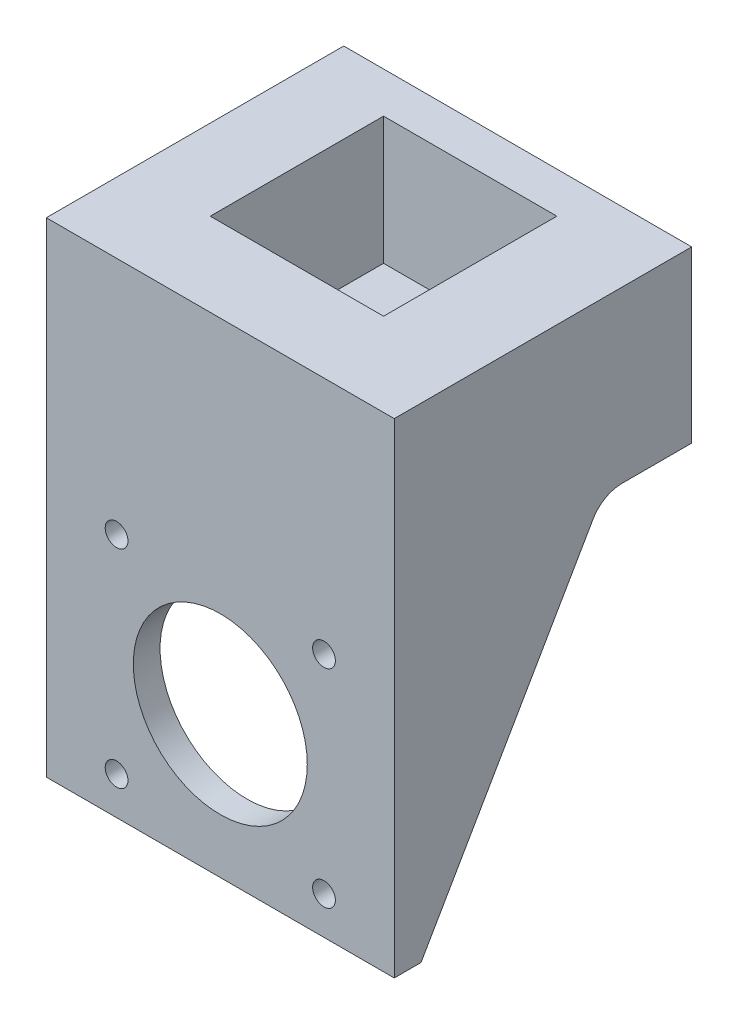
from build123d import *

# Parameters (mm, degrees)
SKETCH1_W           = 83.82
SKETCH1_H           = 25.4
BOSS_EXTRUDE1_DEPTH = 6.35
SKETCH4_W           = 52
SKETCH4_H           = 25.4
BOSS_EXTRUDE2_DEPTH = 44.45
SKETCH5_W           = 25.9
SKETCH5_H           = 25.9
CUT_EXTRUDE1_DEPTH  = 19.05
SKETCH7_R           = 3.429
CUT_EXTRUDE2_DEPTH  = 69.556477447
SKETCH10_W          = 8
SKETCH10_H          = 4
CUT_EXTRUDE3_DEPTH  = 99.831788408
CUT_EXTRUDE4_DEPTH  = 63.398241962
SKETCH11_W          = 83.82
SKETCH11_H          = 25.4
BOSS_EXTRUDE3_DEPTH = 2.54
SKETCH13_W          = 8.89
SKETCH13_H          = 25.4
CUT_EXTRUDE7_DEPTH  = 99.831788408
SKETCH14_W          = 52
SKETCH14_H          = 4
BOSS_EXTRUDE4_DEPTH = 47
BOSS_EXTRUDE7_DEPTH = 3
SKETCH15_R          = 1.7
CUT_EXTRUDE8_DEPTH  = 79.840931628
BOSS_EXTRUDE5_DEPTH = 3
SKETCH19_R          = 13
CUT_EXTRUDE9_DEPTH  = 79.840931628
FILLET3_R           = 5
FILLET4_R           = 5


with BuildPart() as part:
    # Sketch1 → Boss-Extrude1 (new body)
    with BuildSketch(Plane.XY):
        Rectangle(SKETCH1_W, SKETCH1_H)
    extrude(amount=BOSS_EXTRUDE1_DEPTH)

    # Sketch4 → Boss-Extrude2 (add)
    with BuildSketch(Plane.XY.offset(6.35)):
        Rectangle(SKETCH4_W, SKETCH4_H)
    extrude(amount=BOSS_EXTRUDE2_DEPTH)

    # Sketch5 → Cut-Extrude1 (cut)
    with BuildSketch(Plane(origin=(0, 12.7, 0), x_dir=(1, 0, 0), z_dir=(0, 1, 0))):
        with Locations((-1, -25.4)):
            Rectangle(SKETCH5_W, SKETCH5_H)
    extrude(amount=-CUT_EXTRUDE1_DEPTH, mode=Mode.SUBTRACT)

    # Sketch7 → Cut-Extrude2 (cut, through all)
    with BuildSketch(Plane(origin=(0, -6.35, 0), x_dir=(1, 0, 0), z_dir=(0, 1, 0))):
        with Locations(Location((-1, -25.4, 0), (0, 0, 270))):
            Circle(SKETCH7_R)
    extrude(amount=-CUT_EXTRUDE2_DEPTH, mode=Mode.SUBTRACT)

    # Sketch10 → Cut-Extrude3 (cut, through all)
    with BuildSketch(Plane(origin=(41.91, 0, 0), x_dir=(0, 0, -1), z_dir=(1, 0, 0))):
        with Locations((-2.35, 5.62)):
            Rectangle(SKETCH10_W, SKETCH10_H)
    extrude(amount=-CUT_EXTRUDE3_DEPTH, mode=Mode.SUBTRACT)

    # Sketch3 → Cut-Extrude4 (cut, through all)
    with BuildSketch(Plane.XY.offset(6.35)):
        with BuildLine():
            Line((41.91, -6.85999912), (41.91, -7.619999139))
            Line((41.91, -7.619999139), (41.91, -7.819999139))
            Line((41.91, -7.819999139), (31.565, -7.819999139))
            Line((31.565, -7.819999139), (29.050423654, -7.931023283))
            ThreePointArc((29.050423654, -7.931023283), (25.588978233, -9.27852412), (24.142995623, -12.7))
            Line((24.142995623, -12.7), (22.1752021, -12.7))
            ThreePointArc((22.1752021, -12.7), (24.344605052, -7.747051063), (29.45601841, -5.983116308))
            Line((29.45601841, -5.983116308), (32.865217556, -6.1))
            ThreePointArc((32.865217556, -6.1), (33.242134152, -6.253372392), (33.413114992, -6.62263485))
            Line((33.413114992, -6.62263485), (33.415, -6.62263485))
            Line((33.415, -6.62263485), (33.415, -6.71))
            ThreePointArc((33.415, -6.71), (33.458933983, -6.816066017), (33.565, -6.86))
            Line((33.565, -6.86), (34.156206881, -6.860000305))
            ThreePointArc((34.156206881, -6.860000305), (34.266332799, -6.811844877), (34.305750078, -6.698297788))
            ThreePointArc((34.305750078, -6.698297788), (34.304499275, -6.67711281), (34.304059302, -6.655895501))
            Line((34.304059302, -6.655895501), (34.304059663, -6.653448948))
            ThreePointArc((34.304059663, -6.653448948), (34.467161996, -6.262007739), (34.859057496, -6.1))
            Line((34.859057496, -6.1), (34.865217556, -6.1))
            ThreePointArc((34.865217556, -6.1), (35.242134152, -6.253372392), (35.413114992, -6.62263485))
            Line((35.413114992, -6.62263485), (35.415, -6.62263485))
            Line((35.415, -6.62263485), (35.415, -6.71))
            ThreePointArc((35.415, -6.71), (35.458933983, -6.816066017), (35.565, -6.86))
            Line((35.565, -6.86), (36.156206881, -6.860000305))
            ThreePointArc((36.156206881, -6.860000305), (36.266332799, -6.811844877), (36.305750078, -6.698297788))
            ThreePointArc((36.305750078, -6.698297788), (36.304499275, -6.67711281), (36.304059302, -6.655895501))
            Line((36.304059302, -6.655895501), (36.304059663, -6.653448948))
            ThreePointArc((36.304059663, -6.653448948), (36.467161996, -6.262007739), (36.859057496, -6.1))
            Line((36.859057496, -6.1), (36.865218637, -6.1))
            ThreePointArc((36.865218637, -6.1), (37.242151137, -6.253364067), (37.413140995, -6.622635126))
            Line((37.413140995, -6.622635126), (37.415026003, -6.622635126))
            Line((37.415026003, -6.622635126), (37.415026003, -6.710000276))
            ThreePointArc((37.415026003, -6.710000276), (37.458959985, -6.816066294), (37.565026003, -6.860000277))
            Line((37.565026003, -6.860000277), (38.156207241, -6.860000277))
            ThreePointArc((38.156207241, -6.860000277), (38.266333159, -6.811844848), (38.305750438, -6.69829776))
            ThreePointArc((38.305750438, -6.69829776), (38.304499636, -6.677112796), (38.304059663, -6.6558955))
            Line((38.304059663, -6.6558955), (38.304059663, -6.653448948))
            ThreePointArc((38.304059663, -6.653448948), (38.467161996, -6.262007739), (38.859057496, -6.1))
            Line((38.859057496, -6.1), (38.865193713, -6.1))
            ThreePointArc((38.865193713, -6.1), (39.242126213, -6.253364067), (39.413116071, -6.622635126))
            Line((39.413116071, -6.622635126), (39.415001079, -6.622635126))
            Line((39.415001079, -6.622635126), (39.415001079, -6.710000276))
            ThreePointArc((39.415001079, -6.710000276), (39.458935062, -6.816066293), (39.565001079, -6.860000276))
            Line((39.565001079, -6.860000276), (40.156207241, -6.859999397))
            ThreePointArc((40.156207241, -6.859999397), (40.266333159, -6.811843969), (40.305750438, -6.69829688))
            ThreePointArc((40.305750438, -6.69829688), (40.304499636, -6.677111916), (40.304059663, -6.65589462))
            Line((40.304059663, -6.65589462), (40.304059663, -6.653448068))
            ThreePointArc((40.304059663, -6.653448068), (40.467161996, -6.26200686), (40.859057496, -6.09999912))
            Line((40.859057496, -6.09999912), (40.865217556, -6.09999912))
            ThreePointArc((40.865217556, -6.09999912), (41.242134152, -6.253371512), (41.413114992, -6.62263397))
            Line((41.413114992, -6.62263397), (41.415000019, -6.62263397))
            Line((41.415000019, -6.62263397), (41.415000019, -6.70999912))
            ThreePointArc((41.415000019, -6.70999912), (41.458934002, -6.816065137), (41.565000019, -6.85999912))
            Line((41.565000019, -6.85999912), (41.91, -6.85999912))
        make_face()
        with BuildLine():
            Line((-41.910000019, -6.85999912), (-41.910000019, -7.821784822))
            Line((-41.910000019, -7.821784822), (-41.910000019, -8.021784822))
            Line((-41.910000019, -8.021784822), (-22.860000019, -8.021784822))
            Line((-22.860000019, -8.021784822), (-22.860000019, -7.821784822))
            Line((-22.860000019, -7.821784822), (-22.860000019, -7.37263483))
            Line((-22.860000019, -7.37263483), (-22.865217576, -6.099999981))
            ThreePointArc((-22.865217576, -6.099999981), (-23.242134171, -6.253372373), (-23.413115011, -6.62263483))
            Line((-23.413115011, -6.62263483), (-23.415000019, -6.62263483))
            Line((-23.415000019, -6.62263483), (-23.415000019, -6.709999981))
            ThreePointArc((-23.415000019, -6.709999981), (-23.458934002, -6.816065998), (-23.565000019, -6.859999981))
            Line((-23.565000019, -6.859999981), (-24.156207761, -6.860000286))
            ThreePointArc((-24.156207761, -6.860000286), (-24.266333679, -6.811844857), (-24.305750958, -6.698297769))
            ThreePointArc((-24.305750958, -6.698297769), (-24.304480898, -6.676624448), (-24.304059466, -6.654918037))
            Line((-24.304059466, -6.654918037), (-24.304059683, -6.653448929))
            ThreePointArc((-24.304059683, -6.653448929), (-24.467162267, -6.262007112), (-24.859058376, -6.09999912))
            Line((-24.859058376, -6.09999912), (-24.865217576, -6.09999912))
            ThreePointArc((-24.865217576, -6.09999912), (-25.242155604, -6.253318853), (-25.413188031, -6.622557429))
            Line((-25.413188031, -6.622557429), (-25.415075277, -6.622557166))
            Line((-25.415075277, -6.622557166), (-25.415081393, -6.710100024))
            ThreePointArc((-25.415081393, -6.710100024), (-25.459022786, -6.816162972), (-25.565091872, -6.860089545))
            Line((-25.565091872, -6.860089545), (-26.156298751, -6.860048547))
            ThreePointArc((-26.156298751, -6.860048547), (-26.266421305, -6.811885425), (-26.305830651, -6.698335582))
            ThreePointArc((-26.305830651, -6.698335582), (-26.304579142, -6.677170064), (-26.30413698, -6.655972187))
            Line((-26.30413698, -6.655972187), (-26.30413698, -6.653525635))
            ThreePointArc((-26.30413698, -6.653525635), (-26.467212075, -6.262034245), (-26.859135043, -6.09999912))
            Line((-26.859135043, -6.09999912), (-26.865445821, -6.09999912))
            ThreePointArc((-26.865445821, -6.09999912), (-27.242216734, -6.253447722), (-27.413114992, -6.622631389))
            Line((-27.413114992, -6.622631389), (-27.415, -6.622631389))
            Line((-27.415, -6.622631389), (-27.415, -6.71))
            ThreePointArc((-27.415, -6.71), (-27.458933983, -6.816066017), (-27.565, -6.86))
            Line((-27.565, -6.86), (-28.156206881, -6.860000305))
            ThreePointArc((-28.156206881, -6.860000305), (-28.266332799, -6.811844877), (-28.305750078, -6.698297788))
            ThreePointArc((-28.305750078, -6.698297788), (-28.304499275, -6.67711281), (-28.304059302, -6.655895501))
            Line((-28.304059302, -6.655895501), (-28.304059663, -6.653448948))
            ThreePointArc((-28.304059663, -6.653448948), (-28.467161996, -6.262007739), (-28.859057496, -6.1))
            Line((-28.859057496, -6.1), (-28.865217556, -6.1))
            ThreePointArc((-28.865217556, -6.1), (-29.242134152, -6.253372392), (-29.413114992, -6.62263485))
            Line((-29.413114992, -6.62263485), (-29.415, -6.62263485))
            Line((-29.415, -6.62263485), (-29.415, -6.71))
            ThreePointArc((-29.415, -6.71), (-29.458933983, -6.816066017), (-29.565, -6.86))
            Line((-29.565, -6.86), (-30.156206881, -6.860000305))
            ThreePointArc((-30.156206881, -6.860000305), (-30.266332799, -6.811844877), (-30.305750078, -6.698297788))
            ThreePointArc((-30.305750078, -6.698297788), (-30.304499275, -6.67711281), (-30.304059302, -6.655895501))
            Line((-30.304059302, -6.655895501), (-30.304059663, -6.653448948))
            ThreePointArc((-30.304059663, -6.653448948), (-30.467161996, -6.262007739), (-30.859057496, -6.1))
            Line((-30.859057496, -6.1), (-30.865217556, -6.1))
            ThreePointArc((-30.865217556, -6.1), (-31.242134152, -6.253372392), (-31.413114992, -6.62263485))
            Line((-31.413114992, -6.62263485), (-31.415, -6.62263485))
            Line((-31.415, -6.62263485), (-31.415, -6.71))
            ThreePointArc((-31.415, -6.71), (-31.458933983, -6.816066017), (-31.565, -6.86))
            Line((-31.565, -6.86), (-32.156206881, -6.860000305))
            ThreePointArc((-32.156206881, -6.860000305), (-32.266332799, -6.811844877), (-32.305750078, -6.698297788))
            ThreePointArc((-32.305750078, -6.698297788), (-32.304499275, -6.67711281), (-32.304059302, -6.655895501))
            Line((-32.304059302, -6.655895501), (-32.304059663, -6.653448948))
            ThreePointArc((-32.304059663, -6.653448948), (-32.467161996, -6.262007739), (-32.859057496, -6.1))
            Line((-32.859057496, -6.1), (-32.865217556, -6.1))
            ThreePointArc((-32.865217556, -6.1), (-33.242134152, -6.253372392), (-33.413114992, -6.62263485))
            Line((-33.413114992, -6.62263485), (-33.415, -6.62263485))
            Line((-33.415, -6.62263485), (-33.415, -6.71))
            ThreePointArc((-33.415, -6.71), (-33.458933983, -6.816066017), (-33.565, -6.86))
            Line((-33.565, -6.86), (-34.156206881, -6.860000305))
            ThreePointArc((-34.156206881, -6.860000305), (-34.266332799, -6.811844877), (-34.305750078, -6.698297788))
            ThreePointArc((-34.305750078, -6.698297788), (-34.304499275, -6.67711281), (-34.304059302, -6.655895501))
            Line((-34.304059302, -6.655895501), (-34.304059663, -6.653448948))
            ThreePointArc((-34.304059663, -6.653448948), (-34.467161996, -6.262007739), (-34.859057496, -6.1))
            Line((-34.859057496, -6.1), (-34.865217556, -6.1))
            ThreePointArc((-34.865217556, -6.1), (-35.242134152, -6.253372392), (-35.413114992, -6.62263485))
            Line((-35.413114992, -6.62263485), (-35.415, -6.62263485))
            Line((-35.415, -6.62263485), (-35.415, -6.71))
            ThreePointArc((-35.415, -6.71), (-35.458933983, -6.816066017), (-35.565, -6.86))
            Line((-35.565, -6.86), (-36.156206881, -6.860000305))
            ThreePointArc((-36.156206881, -6.860000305), (-36.266332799, -6.811844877), (-36.305750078, -6.698297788))
            ThreePointArc((-36.305750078, -6.698297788), (-36.304499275, -6.67711281), (-36.304059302, -6.655895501))
            Line((-36.304059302, -6.655895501), (-36.304059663, -6.653448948))
            ThreePointArc((-36.304059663, -6.653448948), (-36.467161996, -6.262007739), (-36.859057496, -6.1))
            Line((-36.859057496, -6.1), (-36.865218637, -6.1))
            ThreePointArc((-36.865218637, -6.1), (-37.242151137, -6.253364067), (-37.413140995, -6.622635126))
            Line((-37.413140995, -6.622635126), (-37.415026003, -6.710000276))
            ThreePointArc((-37.415026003, -6.710000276), (-37.458959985, -6.816066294), (-37.565026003, -6.860000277))
            Line((-37.565026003, -6.860000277), (-38.156207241, -6.860000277))
            ThreePointArc((-38.156207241, -6.860000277), (-38.266333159, -6.811844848), (-38.305750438, -6.69829776))
            Line((-38.305750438, -6.69829776), (-38.304059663, -6.653448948))
            ThreePointArc((-38.304059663, -6.653448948), (-38.467161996, -6.262007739), (-38.859057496, -6.1))
            Line((-38.859057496, -6.1), (-38.865193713, -6.1))
            ThreePointArc((-38.865193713, -6.1), (-39.242126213, -6.253364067), (-39.413116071, -6.622635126))
            Line((-39.413116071, -6.622635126), (-39.415001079, -6.710000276))
            ThreePointArc((-39.415001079, -6.710000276), (-39.458935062, -6.816066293), (-39.565001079, -6.860000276))
            Line((-39.565001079, -6.860000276), (-40.156207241, -6.859999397))
            ThreePointArc((-40.156207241, -6.859999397), (-40.266333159, -6.811843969), (-40.305750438, -6.69829688))
            Line((-40.305750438, -6.69829688), (-40.304059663, -6.653448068))
            ThreePointArc((-40.304059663, -6.653448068), (-40.467161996, -6.26200686), (-40.859057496, -6.09999912))
            Line((-40.859057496, -6.09999912), (-40.865217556, -6.09999912))
            ThreePointArc((-40.865217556, -6.09999912), (-41.242134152, -6.253371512), (-41.413114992, -6.62263397))
            Line((-41.413114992, -6.62263397), (-41.415000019, -6.70999912))
            ThreePointArc((-41.415000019, -6.70999912), (-41.458934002, -6.816065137), (-41.565000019, -6.85999912))
            Line((-41.565000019, -6.85999912), (-41.910000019, -6.85999912))
        make_face()
    extrude(amount=-CUT_EXTRUDE4_DEPTH, mode=Mode.SUBTRACT)

    # Sketch11 → Boss-Extrude3 (add)
    with BuildSketch(Plane(origin=(0, 0, 0), x_dir=(-1, 0, 0), z_dir=(0, 0, -1))):
        Rectangle(SKETCH11_W, SKETCH11_H)
    extrude(amount=BOSS_EXTRUDE3_DEPTH)

    # Sketch13 → Cut-Extrude7 (cut, through all)
    with BuildSketch(Plane.ZY.offset(41.91)):
        with Locations((1.905, 0)):
            Rectangle(SKETCH13_W, SKETCH13_H)
    extrude(amount=-CUT_EXTRUDE7_DEPTH, mode=Mode.SUBTRACT)

    # Sketch14 → Boss-Extrude4 (add)
    with BuildSketch(Plane.XZ.offset(12.7)):
        with Locations((0, 48.8)):
            Rectangle(SKETCH14_W, SKETCH14_H)
    extrude(amount=BOSS_EXTRUDE4_DEPTH)

    # Sketch18 → Boss-Extrude7 (add)
    with BuildSketch(Plane.ZY.offset(26)):
        Polygon((46.8, -59.7), (46.8, -12.7), (19.664537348, -12.7), align=None)
    extrude(amount=-BOSS_EXTRUDE7_DEPTH)

    # Sketch15 → Cut-Extrude8 (cut, through all)
    with BuildSketch(Plane.XY.offset(50.8)):
        with Locations((-15.5, -54.05)):
            Circle(SKETCH15_R)
        with Locations((-15.5, -23.05)):
            Circle(SKETCH15_R)
        with Locations((15.5, -54.05)):
            Circle(SKETCH15_R)
        with Locations((15.5, -23.05)):
            Circle(SKETCH15_R)
    extrude(amount=-CUT_EXTRUDE8_DEPTH, mode=Mode.SUBTRACT)

    # Sketch16 → Boss-Extrude5 (add)
    with BuildSketch(Plane(origin=(26, 0, 0), x_dir=(0, 0, -1), z_dir=(1, 0, 0))):
        Polygon((-46.8, -59.7), (-19.664537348, -12.7), (-46.8, -12.7), align=None)
    extrude(amount=-BOSS_EXTRUDE5_DEPTH)

    # Sketch19 → Cut-Extrude9 (cut, through all)
    with BuildSketch(Plane.XY.offset(50.8)):
        with Locations((0, -38.55)):
            Circle(SKETCH19_R)
    extrude(amount=-CUT_EXTRUDE9_DEPTH, mode=Mode.SUBTRACT)

    # Fillet3
    fillet3_edges = [part.edges().sort_by_distance(p)[0] for p in [
        (24.5, -12.7, 19.664537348),
    ]]
    fillet(fillet3_edges, radius=FILLET3_R)

    # Fillet4
    fillet4_edges = [part.edges().sort_by_distance(p)[0] for p in [
        (-24.5, -12.7, 19.664537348),
    ]]
    fillet(fillet4_edges, radius=FILLET4_R)


solid = part.part
